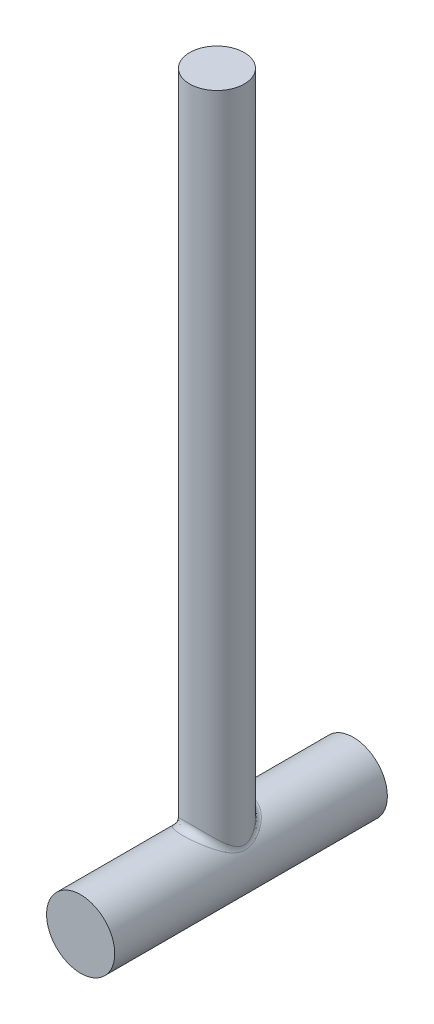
from build123d import *

# Parameters (mm, degrees)
SKETCH1_R           = 5
BOSS_EXTRUDE1_DEPTH = 20
SKETCH2_R           = 4
BOSS_EXTRUDE2_DEPTH = 100
FILLET1_R           = 1


with BuildPart() as part:
    # Sketch1 → Boss-Extrude1 (new, symmetric)
    with BuildSketch(Plane.XY):
        Circle(SKETCH1_R)
    extrude(amount=BOSS_EXTRUDE1_DEPTH, both=True)

    # Sketch2 → Boss-Extrude2 (add)
    with BuildSketch(Plane(origin=(0, 0, 0), x_dir=(1, 0, 0), z_dir=(0, 1, 0))):
        with Locations(Location((0, 0, 0), (0, 0, 90))):
            Circle(SKETCH2_R)
    extrude(amount=BOSS_EXTRUDE2_DEPTH)

    # Fillet1
    fillet1_edges = [part.edges().sort_by_distance(p)[0] for p in [
        (-3e-09, 5.000000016, 4.000000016),
    ]]
    fillet(fillet1_edges, radius=FILLET1_R)


solid = part.part
